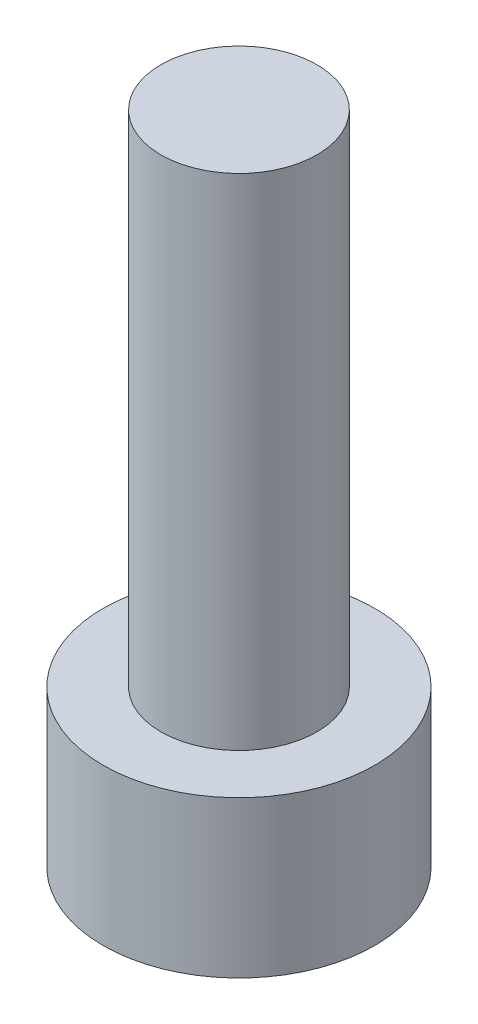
from build123d import *

# Parameters (mm, degrees)
SKETCH_1_R          = 4.35
EXTRUDE_1_DEPTH     = 5
SKETCH_2_R          = 2.5
EXTRUDE_2_DEPTH     = 16
CUT_EXTRUDE_1_DEPTH = 2.5


with BuildPart() as part:
    # Sketch 1 → Extrude 1 (new body)
    with BuildSketch(Plane(origin=(0, 0, 0), x_dir=(1, 0, 0), z_dir=(0, 1, 0))):
        with Locations(Location((0, 0, 0), (0, 0, 270))):
            Circle(SKETCH_1_R)
    extrude(amount=EXTRUDE_1_DEPTH)

    # Sketch 2 → Extrude 2 (add)
    with BuildSketch(Plane(origin=(0, 5, 0), x_dir=(1, 0, 0), z_dir=(0, 1, 0))):
        with Locations(Location((0, 0, 0), (0, 0, 270))):
            Circle(SKETCH_2_R)
    extrude(amount=EXTRUDE_2_DEPTH)

    # Sketch 3 → Cut-Extrude 1 (cut)
    with BuildSketch(Plane.XZ):
        Polygon((1.546358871, -1.715257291), (2.258635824, 0.48155742), (0.712276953, 2.196814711), (-1.546358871, 1.715257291), (-2.258635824, -0.48155742), (-0.712276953, -2.196814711), align=None)
    extrude(amount=-CUT_EXTRUDE_1_DEPTH, mode=Mode.SUBTRACT)


solid = part.part
